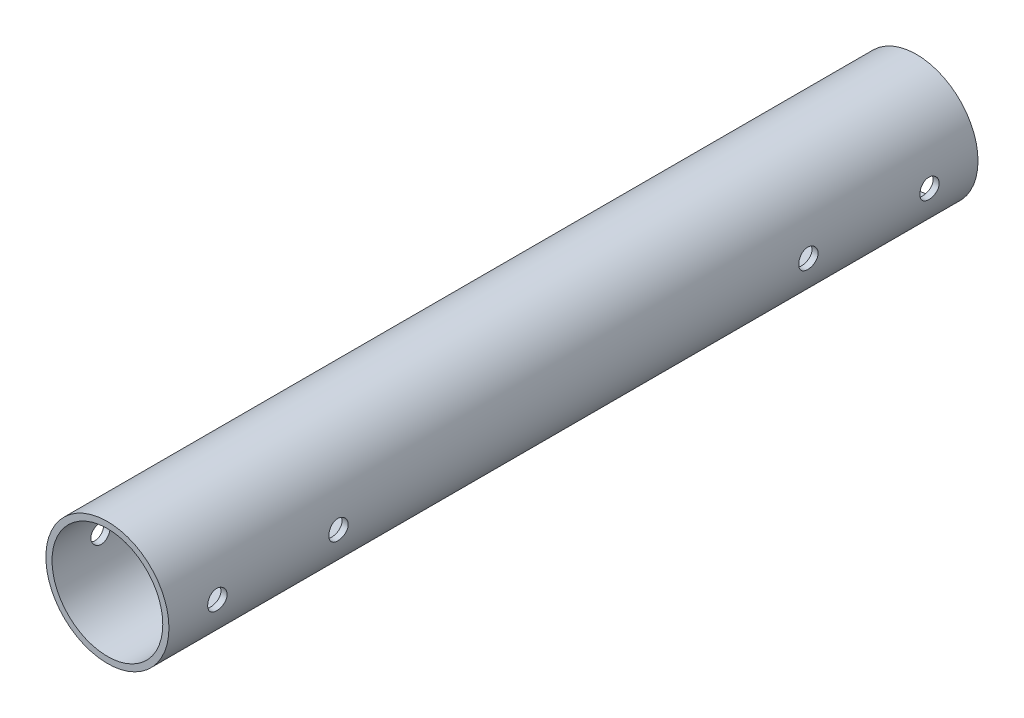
from build123d import *

# Parameters (mm, degrees)
SKETCH1_R               = 12.7
SKETCH1_R_2             = 11.43
BOSS_EXTRUDE1_DEPTH     = 167
CUT_EXTRUDE2_DEPTH      = 168.963031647
CUT_EXTRUDE2_DEPTH_BACK = 168.963031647
SKETCH2_R               = 2


with BuildPart() as part:
    # Sketch1 → Boss-Extrude1 (new body)
    with BuildSketch(Plane(origin=(0, 0, 0), x_dir=(0, 1, 0), z_dir=(0, 0, 1))):
        with Locations(Location((0, 0, 0), (0, 0, 90))):
            Circle(SKETCH1_R)
        with Locations(Location((0, 0, 0), (0, 0, 90))):
            Circle(SKETCH1_R_2, mode=Mode.SUBTRACT)
    extrude(amount=BOSS_EXTRUDE1_DEPTH)

    # Sketch2 → Cut-Extrude2 (cut, two sides: drawn at the far end of the back side and taken through both)
    with BuildSketch(Plane.YZ.offset(-CUT_EXTRUDE2_DEPTH_BACK)):
        with Locations(Location((0, 10, 0), (0, 0, 270))):
            Circle(SKETCH2_R)
        with Locations(Location((0, 35, 0), (0, 0, 270))):
            Circle(SKETCH2_R)
        with Locations(Location((0, 157, 0), (0, 0, 270))):
            Circle(SKETCH2_R)
        with Locations(Location((0, 132, 0), (0, 0, 270))):
            Circle(SKETCH2_R)
    extrude(amount=CUT_EXTRUDE2_DEPTH + CUT_EXTRUDE2_DEPTH_BACK, mode=Mode.SUBTRACT)


solid = part.part
